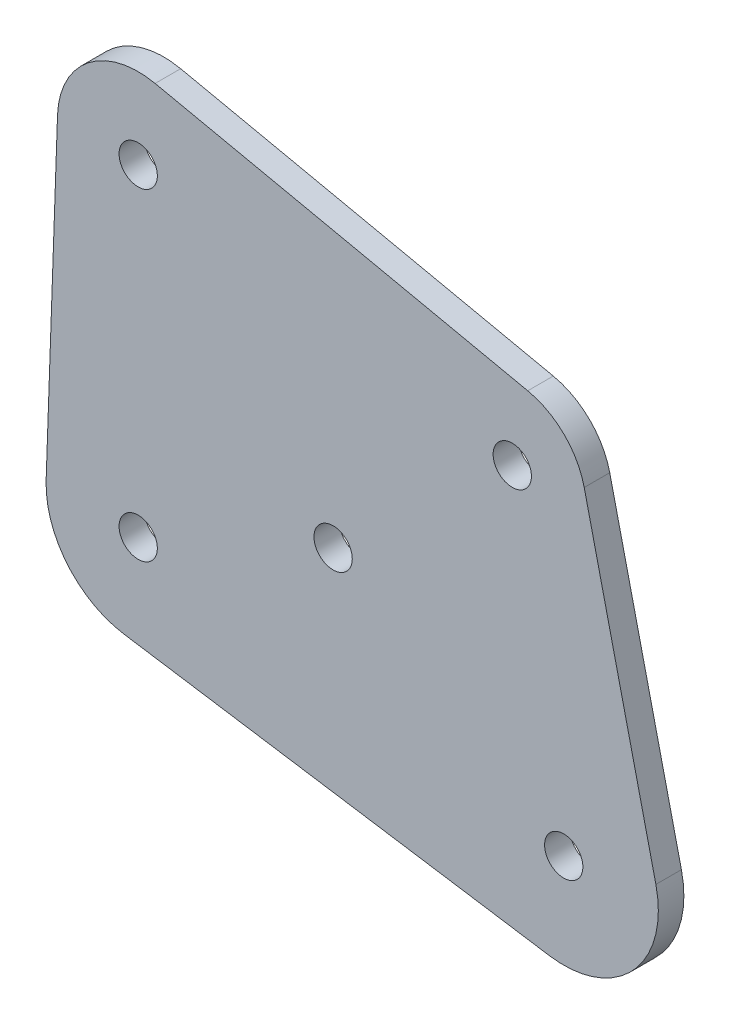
ISO-10303-21;
HEADER;
FILE_DESCRIPTION(('STEP AP214'),'2;1');
FILE_NAME('part.step','',(''),(''),'','','');
FILE_SCHEMA(('AUTOMOTIVE_DESIGN { 1 0 10303 214 1 1 1 1 }'));
ENDSEC;
DATA;
#1=APPLICATION_CONTEXT('core data for automotive mechanical design processes');
#2=APPLICATION_PROTOCOL_DEFINITION('international standard','automotive_design',2000,#1);
#3=PRODUCT_CONTEXT('',#1,'mechanical');
#4=PRODUCT('Part','Part','',(#3));
#5=PRODUCT_RELATED_PRODUCT_CATEGORY('part','',(#4));
#6=PRODUCT_DEFINITION_FORMATION('','',#4);
#7=PRODUCT_DEFINITION_CONTEXT('part definition',#1,'design');
#8=PRODUCT_DEFINITION('design','',#6,#7);
#9=PRODUCT_DEFINITION_SHAPE('','',#8);
#10=(LENGTH_UNIT() NAMED_UNIT(*) SI_UNIT(.MILLI.,.METRE.));
#11=(NAMED_UNIT(*) PLANE_ANGLE_UNIT() SI_UNIT($,.RADIAN.));
#12=(NAMED_UNIT(*) SI_UNIT($,.STERADIAN.) SOLID_ANGLE_UNIT());
#13=UNCERTAINTY_MEASURE_WITH_UNIT(LENGTH_MEASURE(1.E-05),#10,'distance_accuracy_value','');
#14=(GEOMETRIC_REPRESENTATION_CONTEXT(3) GLOBAL_UNCERTAINTY_ASSIGNED_CONTEXT((#13)) GLOBAL_UNIT_ASSIGNED_CONTEXT((#10,
#11,#12)) REPRESENTATION_CONTEXT('',''));
#15=CARTESIAN_POINT('',(0.,0.,0.));
#16=DIRECTION('',(0.,0.,1.));
#17=DIRECTION('',(1.,0.,0.));
#18=AXIS2_PLACEMENT_3D('',#15,#16,#17);
#19=CARTESIAN_POINT('',(1219.2,0.,25.4));
#20=DIRECTION('',(0.,0.,-1.));
#21=DIRECTION('',(-1.,0.,0.));
#22=AXIS2_PLACEMENT_3D('',#19,#20,#21);
#23=PLANE('',#22);
#24=CARTESIAN_POINT('',(325.83500035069,644.018315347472,25.4));
#25=DIRECTION('',(0.,0.,1.));
#26=DIRECTION('',(1.,0.,0.));
#27=AXIS2_PLACEMENT_3D('',#24,#25,#26);
#28=CIRCLE('',#27,19.05);
#29=CARTESIAN_POINT('',(344.88500035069,644.018315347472,25.4));
#30=VERTEX_POINT('',#29);
#31=EDGE_CURVE('E41',#30,#30,#28,.T.);
#32=ORIENTED_EDGE('',*,*,#31,.F.);
#33=EDGE_LOOP('',(#32));
#34=FACE_BOUND('',#33,.T.);
#35=CARTESIAN_POINT('',(697.941392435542,571.237089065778,25.4));
#36=DIRECTION('',(0.,0.,1.));
#37=DIRECTION('',(1.,0.,0.));
#38=AXIS2_PLACEMENT_3D('',#35,#36,#37);
#39=CIRCLE('',#38,19.05);
#40=CARTESIAN_POINT('',(716.991392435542,571.237089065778,25.4));
#41=VERTEX_POINT('',#40);
#42=EDGE_CURVE('E185',#41,#41,#39,.T.);
#43=ORIENTED_EDGE('',*,*,#42,.F.);
#44=EDGE_LOOP('',(#43));
#45=FACE_BOUND('',#44,.T.);
#46=CARTESIAN_POINT('',(519.736439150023,410.993406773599,25.4));
#47=DIRECTION('',(0.,0.,1.));
#48=DIRECTION('',(1.,0.,0.));
#49=AXIS2_PLACEMENT_3D('',#46,#47,#48);
#50=CIRCLE('',#49,19.05);
#51=CARTESIAN_POINT('',(538.786439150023,410.993406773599,25.4));
#52=VERTEX_POINT('',#51);
#53=EDGE_CURVE('E179',#52,#52,#50,.T.);
#54=ORIENTED_EDGE('',*,*,#53,.F.);
#55=EDGE_LOOP('',(#54));
#56=FACE_BOUND('',#55,.T.);
#57=CARTESIAN_POINT('',(749.130631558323,260.234388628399,25.4));
#58=DIRECTION('',(0.,0.,1.));
#59=DIRECTION('',(1.,0.,0.));
#60=AXIS2_PLACEMENT_3D('',#57,#58,#59);
#61=CIRCLE('',#60,19.05);
#62=CARTESIAN_POINT('',(768.180631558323,260.234388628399,25.4));
#63=VERTEX_POINT('',#62);
#64=EDGE_CURVE('E173',#63,#63,#61,.T.);
#65=ORIENTED_EDGE('',*,*,#64,.F.);
#66=EDGE_LOOP('',(#65));
#67=FACE_BOUND('',#66,.T.);
#68=CARTESIAN_POINT('',(325.83500035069,323.166907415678,25.4));
#69=DIRECTION('',(0.,0.,1.));
#70=DIRECTION('',(1.,0.,0.));
#71=AXIS2_PLACEMENT_3D('',#68,#69,#70);
#72=CIRCLE('',#71,19.05);
#73=CARTESIAN_POINT('',(344.88500035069,323.166907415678,25.4));
#74=VERTEX_POINT('',#73);
#75=EDGE_CURVE('E160',#74,#74,#72,.T.);
#76=ORIENTED_EDGE('',*,*,#75,.F.);
#77=EDGE_LOOP('',(#76));
#78=FACE_BOUND('',#77,.T.);
#79=CARTESIAN_POINT('',(325.83500035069,644.018315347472,25.4));
#80=DIRECTION('',(0.,0.,1.));
#81=DIRECTION('',(1.,0.,0.));
#82=AXIS2_PLACEMENT_3D('',#79,#80,#81);
#83=CIRCLE('',#82,80.2944043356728);
#84=CARTESIAN_POINT('',(342.660219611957,722.53011932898,25.4));
#85=VERTEX_POINT('',#84);
#86=CARTESIAN_POINT('',(245.590918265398,646.860613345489,25.4));
#87=VERTEX_POINT('',#86);
#88=EDGE_CURVE('E138',#85,#87,#83,.T.);
#89=ORIENTED_EDGE('',*,*,#88,.T.);
#90=DIRECTION('',(-0.0353984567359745,-0.999373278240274,0.));
#91=VECTOR('',#90,1.);
#92=CARTESIAN_POINT('',(245.590918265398,646.860613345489,25.4));
#93=LINE('',#92,#91);
#94=CARTESIAN_POINT('',(234.24039166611,326.411248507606,25.4));
#95=VERTEX_POINT('',#94);
#96=EDGE_CURVE('E141',#87,#95,#93,.T.);
#97=ORIENTED_EDGE('',*,*,#96,.T.);
#98=CARTESIAN_POINT('',(325.83500035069,323.166907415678,25.4));
#99=DIRECTION('',(0.,0.,1.));
#100=DIRECTION('',(1.,0.,0.));
#101=AXIS2_PLACEMENT_3D('',#98,#99,#100);
#102=CIRCLE('',#101,91.652049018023);
#103=CARTESIAN_POINT('',(311.834339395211,232.590533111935,25.4));
#104=VERTEX_POINT('',#103);
#105=EDGE_CURVE('E52',#95,#104,#102,.T.);
#106=ORIENTED_EDGE('',*,*,#105,.T.);
#107=DIRECTION('',(0.988263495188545,-0.152758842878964,0.));
#108=VECTOR('',#107,1.);
#109=CARTESIAN_POINT('',(311.834339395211,232.590533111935,25.4));
#110=LINE('',#109,#108);
#111=CARTESIAN_POINT('',(734.752925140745,167.218742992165,25.4));
#112=VERTEX_POINT('',#111);
#113=EDGE_CURVE('E109',#104,#112,#110,.T.);
#114=ORIENTED_EDGE('',*,*,#113,.T.);
#115=CARTESIAN_POINT('',(749.130631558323,260.234388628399,25.4));
#116=DIRECTION('',(0.,0.,1.));
#117=DIRECTION('',(1.,0.,0.));
#118=AXIS2_PLACEMENT_3D('',#115,#116,#117);
#119=CIRCLE('',#118,94.120288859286);
#120=CARTESIAN_POINT('',(840.801457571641,281.567190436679,25.4));
#121=VERTEX_POINT('',#120);
#122=EDGE_CURVE('E146',#112,#121,#119,.T.);
#123=ORIENTED_EDGE('',*,*,#122,.T.);
#124=DIRECTION('',(-0.226654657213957,0.973975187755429,0.));
#125=VECTOR('',#124,1.);
#126=CARTESIAN_POINT('',(840.801457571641,281.567190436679,25.4));
#127=LINE('',#126,#125);
#128=CARTESIAN_POINT('',(769.516030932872,587.893288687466,25.4));
#129=VERTEX_POINT('',#128);
#130=EDGE_CURVE('E149',#121,#129,#127,.T.);
#131=ORIENTED_EDGE('',*,*,#130,.T.);
#132=CARTESIAN_POINT('',(697.941392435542,571.237089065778,25.4));
#133=DIRECTION('',(0.,0.,1.));
#134=DIRECTION('',(1.,0.,0.));
#135=AXIS2_PLACEMENT_3D('',#132,#133,#134);
#136=CIRCLE('',#135,73.4871271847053);
#137=CARTESIAN_POINT('',(713.34018688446,643.09274292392,25.4));
#138=VERTEX_POINT('',#137);
#139=EDGE_CURVE('E152',#129,#138,#136,.T.);
#140=ORIENTED_EDGE('',*,*,#139,.T.);
#141=DIRECTION('',(-0.977799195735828,0.209544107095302,0.));
#142=VECTOR('',#141,1.);
#143=CARTESIAN_POINT('',(713.34018688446,643.09274292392,25.4));
#144=LINE('',#143,#142);
#145=EDGE_CURVE('E155',#138,#85,#144,.T.);
#146=ORIENTED_EDGE('',*,*,#145,.T.);
#147=EDGE_LOOP('',(#89,#97,#106,#114,#123,#131,#140,#146));
#148=FACE_BOUND('',#147,.T.);
#149=ADVANCED_FACE('F37',(#34,#45,#56,#67,#78,#148),#23,.F.);
#150=CARTESIAN_POINT('',(1219.2,0.,0.));
#151=DIRECTION('',(0.,0.,-1.));
#152=DIRECTION('',(-1.,0.,0.));
#153=AXIS2_PLACEMENT_3D('',#150,#151,#152);
#154=PLANE('',#153);
#155=CARTESIAN_POINT('',(325.83500035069,644.018315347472,0.));
#156=DIRECTION('',(0.,0.,1.));
#157=DIRECTION('',(1.,0.,0.));
#158=AXIS2_PLACEMENT_3D('',#155,#156,#157);
#159=CIRCLE('',#158,19.05);
#160=CARTESIAN_POINT('',(344.88500035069,644.018315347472,0.));
#161=VERTEX_POINT('',#160);
#162=EDGE_CURVE('E12',#161,#161,#159,.T.);
#163=ORIENTED_EDGE('',*,*,#162,.T.);
#164=EDGE_LOOP('',(#163));
#165=FACE_BOUND('',#164,.T.);
#166=CARTESIAN_POINT('',(697.941392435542,571.237089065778,0.));
#167=DIRECTION('',(0.,0.,1.));
#168=DIRECTION('',(1.,0.,0.));
#169=AXIS2_PLACEMENT_3D('',#166,#167,#168);
#170=CIRCLE('',#169,19.05);
#171=CARTESIAN_POINT('',(716.991392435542,571.237089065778,0.));
#172=VERTEX_POINT('',#171);
#173=EDGE_CURVE('E188',#172,#172,#170,.T.);
#174=ORIENTED_EDGE('',*,*,#173,.T.);
#175=EDGE_LOOP('',(#174));
#176=FACE_BOUND('',#175,.T.);
#177=CARTESIAN_POINT('',(519.736439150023,410.993406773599,0.));
#178=DIRECTION('',(0.,0.,1.));
#179=DIRECTION('',(1.,0.,0.));
#180=AXIS2_PLACEMENT_3D('',#177,#178,#179);
#181=CIRCLE('',#180,19.05);
#182=CARTESIAN_POINT('',(538.786439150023,410.993406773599,0.));
#183=VERTEX_POINT('',#182);
#184=EDGE_CURVE('E182',#183,#183,#181,.T.);
#185=ORIENTED_EDGE('',*,*,#184,.T.);
#186=EDGE_LOOP('',(#185));
#187=FACE_BOUND('',#186,.T.);
#188=CARTESIAN_POINT('',(749.130631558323,260.234388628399,0.));
#189=DIRECTION('',(0.,0.,1.));
#190=DIRECTION('',(1.,0.,0.));
#191=AXIS2_PLACEMENT_3D('',#188,#189,#190);
#192=CIRCLE('',#191,19.05);
#193=CARTESIAN_POINT('',(768.180631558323,260.234388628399,0.));
#194=VERTEX_POINT('',#193);
#195=EDGE_CURVE('E176',#194,#194,#192,.T.);
#196=ORIENTED_EDGE('',*,*,#195,.T.);
#197=EDGE_LOOP('',(#196));
#198=FACE_BOUND('',#197,.T.);
#199=CARTESIAN_POINT('',(325.83500035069,323.166907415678,0.));
#200=DIRECTION('',(0.,0.,1.));
#201=DIRECTION('',(1.,0.,0.));
#202=AXIS2_PLACEMENT_3D('',#199,#200,#201);
#203=CIRCLE('',#202,19.05);
#204=CARTESIAN_POINT('',(344.88500035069,323.166907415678,0.));
#205=VERTEX_POINT('',#204);
#206=EDGE_CURVE('E170',#205,#205,#203,.T.);
#207=ORIENTED_EDGE('',*,*,#206,.T.);
#208=EDGE_LOOP('',(#207));
#209=FACE_BOUND('',#208,.T.);
#210=DIRECTION('',(-0.0353984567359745,-0.999373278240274,0.));
#211=VECTOR('',#210,1.);
#212=CARTESIAN_POINT('',(245.590918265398,646.860613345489,0.));
#213=LINE('',#212,#211);
#214=CARTESIAN_POINT('',(245.590918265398,646.860613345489,0.));
#215=VERTEX_POINT('',#214);
#216=CARTESIAN_POINT('',(234.24039166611,326.411248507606,0.));
#217=VERTEX_POINT('',#216);
#218=EDGE_CURVE('E119',#215,#217,#213,.T.);
#219=ORIENTED_EDGE('',*,*,#218,.F.);
#220=CARTESIAN_POINT('',(325.83500035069,644.018315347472,0.));
#221=DIRECTION('',(0.,0.,1.));
#222=DIRECTION('',(1.,0.,0.));
#223=AXIS2_PLACEMENT_3D('',#220,#221,#222);
#224=CIRCLE('',#223,80.2944043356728);
#225=CARTESIAN_POINT('',(342.660219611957,722.53011932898,0.));
#226=VERTEX_POINT('',#225);
#227=EDGE_CURVE('E60',#226,#215,#224,.T.);
#228=ORIENTED_EDGE('',*,*,#227,.F.);
#229=DIRECTION('',(-0.977799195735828,0.209544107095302,0.));
#230=VECTOR('',#229,1.);
#231=CARTESIAN_POINT('',(713.34018688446,643.09274292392,0.));
#232=LINE('',#231,#230);
#233=CARTESIAN_POINT('',(713.34018688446,643.09274292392,0.));
#234=VERTEX_POINT('',#233);
#235=EDGE_CURVE('E134',#234,#226,#232,.T.);
#236=ORIENTED_EDGE('',*,*,#235,.F.);
#237=CARTESIAN_POINT('',(697.941392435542,571.237089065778,0.));
#238=DIRECTION('',(0.,0.,1.));
#239=DIRECTION('',(1.,0.,0.));
#240=AXIS2_PLACEMENT_3D('',#237,#238,#239);
#241=CIRCLE('',#240,73.4871271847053);
#242=CARTESIAN_POINT('',(769.516030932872,587.893288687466,0.));
#243=VERTEX_POINT('',#242);
#244=EDGE_CURVE('E131',#243,#234,#241,.T.);
#245=ORIENTED_EDGE('',*,*,#244,.F.);
#246=DIRECTION('',(-0.226654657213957,0.973975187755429,0.));
#247=VECTOR('',#246,1.);
#248=CARTESIAN_POINT('',(840.801457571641,281.567190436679,0.));
#249=LINE('',#248,#247);
#250=CARTESIAN_POINT('',(840.801457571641,281.567190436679,0.));
#251=VERTEX_POINT('',#250);
#252=EDGE_CURVE('E125',#251,#243,#249,.T.);
#253=ORIENTED_EDGE('',*,*,#252,.F.);
#254=CARTESIAN_POINT('',(749.130631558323,260.234388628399,0.));
#255=DIRECTION('',(0.,0.,1.));
#256=DIRECTION('',(1.,0.,0.));
#257=AXIS2_PLACEMENT_3D('',#254,#255,#256);
#258=CIRCLE('',#257,94.120288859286);
#259=CARTESIAN_POINT('',(734.752925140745,167.218742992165,0.));
#260=VERTEX_POINT('',#259);
#261=EDGE_CURVE('E123',#260,#251,#258,.T.);
#262=ORIENTED_EDGE('',*,*,#261,.F.);
#263=DIRECTION('',(0.988263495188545,-0.152758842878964,0.));
#264=VECTOR('',#263,1.);
#265=CARTESIAN_POINT('',(311.834339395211,232.590533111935,0.));
#266=LINE('',#265,#264);
#267=CARTESIAN_POINT('',(311.834339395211,232.590533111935,0.));
#268=VERTEX_POINT('',#267);
#269=EDGE_CURVE('E106',#268,#260,#266,.T.);
#270=ORIENTED_EDGE('',*,*,#269,.F.);
#271=CARTESIAN_POINT('',(325.83500035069,323.166907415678,0.));
#272=DIRECTION('',(0.,0.,1.));
#273=DIRECTION('',(1.,0.,0.));
#274=AXIS2_PLACEMENT_3D('',#271,#272,#273);
#275=CIRCLE('',#274,91.652049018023);
#276=EDGE_CURVE('E114',#217,#268,#275,.T.);
#277=ORIENTED_EDGE('',*,*,#276,.F.);
#278=EDGE_LOOP('',(#219,#228,#236,#245,#253,#262,#270,#277));
#279=FACE_BOUND('',#278,.T.);
#280=ADVANCED_FACE('F39',(#165,#176,#187,#198,#209,#279),#154,.T.);
#281=CARTESIAN_POINT('',(325.83500035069,644.018315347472,0.));
#282=DIRECTION('',(0.,0.,1.));
#283=DIRECTION('',(1.,0.,0.));
#284=AXIS2_PLACEMENT_3D('',#281,#282,#283);
#285=CYLINDRICAL_SURFACE('',#284,19.05);
#286=ORIENTED_EDGE('',*,*,#162,.F.);
#287=EDGE_LOOP('',(#286));
#288=FACE_BOUND('',#287,.T.);
#289=ORIENTED_EDGE('',*,*,#31,.T.);
#290=EDGE_LOOP('',(#289));
#291=FACE_BOUND('',#290,.T.);
#292=ADVANCED_FACE('F255',(#288,#291),#285,.F.);
#293=CARTESIAN_POINT('',(697.941392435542,571.237089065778,0.));
#294=DIRECTION('',(0.,0.,1.));
#295=DIRECTION('',(1.,0.,0.));
#296=AXIS2_PLACEMENT_3D('',#293,#294,#295);
#297=CYLINDRICAL_SURFACE('',#296,19.05);
#298=ORIENTED_EDGE('',*,*,#173,.F.);
#299=EDGE_LOOP('',(#298));
#300=FACE_BOUND('',#299,.T.);
#301=ORIENTED_EDGE('',*,*,#42,.T.);
#302=EDGE_LOOP('',(#301));
#303=FACE_BOUND('',#302,.T.);
#304=ADVANCED_FACE('F194',(#300,#303),#297,.F.);
#305=CARTESIAN_POINT('',(519.736439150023,410.993406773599,0.));
#306=DIRECTION('',(0.,0.,1.));
#307=DIRECTION('',(1.,0.,0.));
#308=AXIS2_PLACEMENT_3D('',#305,#306,#307);
#309=CYLINDRICAL_SURFACE('',#308,19.05);
#310=ORIENTED_EDGE('',*,*,#184,.F.);
#311=EDGE_LOOP('',(#310));
#312=FACE_BOUND('',#311,.T.);
#313=ORIENTED_EDGE('',*,*,#53,.T.);
#314=EDGE_LOOP('',(#313));
#315=FACE_BOUND('',#314,.T.);
#316=ADVANCED_FACE('F248',(#312,#315),#309,.F.);
#317=CARTESIAN_POINT('',(749.130631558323,260.234388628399,0.));
#318=DIRECTION('',(0.,0.,1.));
#319=DIRECTION('',(1.,0.,0.));
#320=AXIS2_PLACEMENT_3D('',#317,#318,#319);
#321=CYLINDRICAL_SURFACE('',#320,19.05);
#322=ORIENTED_EDGE('',*,*,#195,.F.);
#323=EDGE_LOOP('',(#322));
#324=FACE_BOUND('',#323,.T.);
#325=ORIENTED_EDGE('',*,*,#64,.T.);
#326=EDGE_LOOP('',(#325));
#327=FACE_BOUND('',#326,.T.);
#328=ADVANCED_FACE('F244',(#324,#327),#321,.F.);
#329=CARTESIAN_POINT('',(325.83500035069,323.166907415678,0.));
#330=DIRECTION('',(0.,0.,1.));
#331=DIRECTION('',(1.,0.,0.));
#332=AXIS2_PLACEMENT_3D('',#329,#330,#331);
#333=CYLINDRICAL_SURFACE('',#332,19.05);
#334=ORIENTED_EDGE('',*,*,#206,.F.);
#335=EDGE_LOOP('',(#334));
#336=FACE_BOUND('',#335,.T.);
#337=ORIENTED_EDGE('',*,*,#75,.T.);
#338=EDGE_LOOP('',(#337));
#339=FACE_BOUND('',#338,.T.);
#340=ADVANCED_FACE('F241',(#336,#339),#333,.F.);
#341=CARTESIAN_POINT('',(325.83500035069,644.018315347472,0.));
#342=DIRECTION('',(0.,0.,1.));
#343=DIRECTION('',(1.,0.,0.));
#344=AXIS2_PLACEMENT_3D('',#341,#342,#343);
#345=CYLINDRICAL_SURFACE('',#344,80.2944043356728);
#346=ORIENTED_EDGE('',*,*,#88,.F.);
#347=DIRECTION('',(0.,0.,1.));
#348=VECTOR('',#347,1.);
#349=CARTESIAN_POINT('',(342.660219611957,722.53011932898,0.));
#350=LINE('',#349,#348);
#351=EDGE_CURVE('E158',#226,#85,#350,.T.);
#352=ORIENTED_EDGE('',*,*,#351,.F.);
#353=ORIENTED_EDGE('',*,*,#227,.T.);
#354=DIRECTION('',(0.,0.,1.));
#355=VECTOR('',#354,1.);
#356=CARTESIAN_POINT('',(245.590918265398,646.860613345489,0.));
#357=LINE('',#356,#355);
#358=EDGE_CURVE('E137',#215,#87,#357,.T.);
#359=ORIENTED_EDGE('',*,*,#358,.T.);
#360=EDGE_LOOP('',(#346,#352,#353,#359));
#361=FACE_BOUND('',#360,.T.);
#362=ADVANCED_FACE('F208',(#361),#345,.T.);
#363=CARTESIAN_POINT('',(713.34018688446,643.09274292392,0.));
#364=DIRECTION('',(0.209544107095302,0.977799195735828,0.));
#365=DIRECTION('',(-0.977799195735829,0.209544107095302,0.));
#366=AXIS2_PLACEMENT_3D('',#363,#364,#365);
#367=PLANE('',#366);
#368=ORIENTED_EDGE('',*,*,#145,.F.);
#369=DIRECTION('',(0.,0.,1.));
#370=VECTOR('',#369,1.);
#371=CARTESIAN_POINT('',(713.34018688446,643.09274292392,0.));
#372=LINE('',#371,#370);
#373=EDGE_CURVE('E161',#234,#138,#372,.T.);
#374=ORIENTED_EDGE('',*,*,#373,.F.);
#375=ORIENTED_EDGE('',*,*,#235,.T.);
#376=ORIENTED_EDGE('',*,*,#351,.T.);
#377=EDGE_LOOP('',(#368,#374,#375,#376));
#378=FACE_BOUND('',#377,.T.);
#379=ADVANCED_FACE('F215',(#378),#367,.T.);
#380=CARTESIAN_POINT('',(697.941392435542,571.237089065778,0.));
#381=DIRECTION('',(0.,0.,1.));
#382=DIRECTION('',(1.,0.,0.));
#383=AXIS2_PLACEMENT_3D('',#380,#381,#382);
#384=CYLINDRICAL_SURFACE('',#383,73.4871271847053);
#385=ORIENTED_EDGE('',*,*,#139,.F.);
#386=DIRECTION('',(0.,0.,1.));
#387=VECTOR('',#386,1.);
#388=CARTESIAN_POINT('',(769.516030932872,587.893288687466,0.));
#389=LINE('',#388,#387);
#390=EDGE_CURVE('E163',#243,#129,#389,.T.);
#391=ORIENTED_EDGE('',*,*,#390,.F.);
#392=ORIENTED_EDGE('',*,*,#244,.T.);
#393=ORIENTED_EDGE('',*,*,#373,.T.);
#394=EDGE_LOOP('',(#385,#391,#392,#393));
#395=FACE_BOUND('',#394,.T.);
#396=ADVANCED_FACE('F218',(#395),#384,.T.);
#397=CARTESIAN_POINT('',(840.801457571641,281.567190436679,0.));
#398=DIRECTION('',(0.973975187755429,0.226654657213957,0.));
#399=DIRECTION('',(-0.226654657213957,0.973975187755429,0.));
#400=AXIS2_PLACEMENT_3D('',#397,#398,#399);
#401=PLANE('',#400);
#402=ORIENTED_EDGE('',*,*,#130,.F.);
#403=DIRECTION('',(0.,0.,1.));
#404=VECTOR('',#403,1.);
#405=CARTESIAN_POINT('',(840.801457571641,281.567190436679,0.));
#406=LINE('',#405,#404);
#407=EDGE_CURVE('E165',#251,#121,#406,.T.);
#408=ORIENTED_EDGE('',*,*,#407,.F.);
#409=ORIENTED_EDGE('',*,*,#252,.T.);
#410=ORIENTED_EDGE('',*,*,#390,.T.);
#411=EDGE_LOOP('',(#402,#408,#409,#410));
#412=FACE_BOUND('',#411,.T.);
#413=ADVANCED_FACE('F221',(#412),#401,.T.);
#414=CARTESIAN_POINT('',(749.130631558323,260.234388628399,0.));
#415=DIRECTION('',(0.,0.,1.));
#416=DIRECTION('',(1.,0.,0.));
#417=AXIS2_PLACEMENT_3D('',#414,#415,#416);
#418=CYLINDRICAL_SURFACE('',#417,94.120288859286);
#419=ORIENTED_EDGE('',*,*,#122,.F.);
#420=DIRECTION('',(0.,0.,1.));
#421=VECTOR('',#420,1.);
#422=CARTESIAN_POINT('',(734.752925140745,167.218742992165,0.));
#423=LINE('',#422,#421);
#424=EDGE_CURVE('E110',#260,#112,#423,.T.);
#425=ORIENTED_EDGE('',*,*,#424,.F.);
#426=ORIENTED_EDGE('',*,*,#261,.T.);
#427=ORIENTED_EDGE('',*,*,#407,.T.);
#428=EDGE_LOOP('',(#419,#425,#426,#427));
#429=FACE_BOUND('',#428,.T.);
#430=ADVANCED_FACE('F224',(#429),#418,.T.);
#431=CARTESIAN_POINT('',(311.834339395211,232.590533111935,0.));
#432=DIRECTION('',(-0.152758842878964,-0.988263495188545,0.));
#433=DIRECTION('',(0.988263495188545,-0.152758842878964,0.));
#434=AXIS2_PLACEMENT_3D('',#431,#432,#433);
#435=PLANE('',#434);
#436=ORIENTED_EDGE('',*,*,#113,.F.);
#437=DIRECTION('',(0.,0.,1.));
#438=VECTOR('',#437,1.);
#439=CARTESIAN_POINT('',(311.834339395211,232.590533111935,0.));
#440=LINE('',#439,#438);
#441=EDGE_CURVE('E102',#268,#104,#440,.T.);
#442=ORIENTED_EDGE('',*,*,#441,.F.);
#443=ORIENTED_EDGE('',*,*,#269,.T.);
#444=ORIENTED_EDGE('',*,*,#424,.T.);
#445=EDGE_LOOP('',(#436,#442,#443,#444));
#446=FACE_BOUND('',#445,.T.);
#447=ADVANCED_FACE('F104',(#446),#435,.T.);
#448=CARTESIAN_POINT('',(325.83500035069,323.166907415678,0.));
#449=DIRECTION('',(0.,0.,1.));
#450=DIRECTION('',(1.,0.,0.));
#451=AXIS2_PLACEMENT_3D('',#448,#449,#450);
#452=CYLINDRICAL_SURFACE('',#451,91.652049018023);
#453=ORIENTED_EDGE('',*,*,#105,.F.);
#454=DIRECTION('',(0.,0.,1.));
#455=VECTOR('',#454,1.);
#456=CARTESIAN_POINT('',(234.24039166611,326.411248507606,0.));
#457=LINE('',#456,#455);
#458=EDGE_CURVE('E111',#217,#95,#457,.T.);
#459=ORIENTED_EDGE('',*,*,#458,.F.);
#460=ORIENTED_EDGE('',*,*,#276,.T.);
#461=ORIENTED_EDGE('',*,*,#441,.T.);
#462=EDGE_LOOP('',(#453,#459,#460,#461));
#463=FACE_BOUND('',#462,.T.);
#464=ADVANCED_FACE('F115',(#463),#452,.T.);
#465=CARTESIAN_POINT('',(245.590918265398,646.860613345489,0.));
#466=DIRECTION('',(-0.999373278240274,0.0353984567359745,0.));
#467=DIRECTION('',(-0.0353984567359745,-0.999373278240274,0.));
#468=AXIS2_PLACEMENT_3D('',#465,#466,#467);
#469=PLANE('',#468);
#470=ORIENTED_EDGE('',*,*,#96,.F.);
#471=ORIENTED_EDGE('',*,*,#358,.F.);
#472=ORIENTED_EDGE('',*,*,#218,.T.);
#473=ORIENTED_EDGE('',*,*,#458,.T.);
#474=EDGE_LOOP('',(#470,#471,#472,#473));
#475=FACE_BOUND('',#474,.T.);
#476=ADVANCED_FACE('F210',(#475),#469,.T.);
#477=CLOSED_SHELL('',(#149,#280,#292,#304,#316,#328,#340,#362,#379,#396,#413,#430,#447,#464,#476));
#478=MANIFOLD_SOLID_BREP('B2',#477);
#479=ADVANCED_BREP_SHAPE_REPRESENTATION('',(#18,#478),#14);
#480=SHAPE_DEFINITION_REPRESENTATION(#9,#479);
ENDSEC;
END-ISO-10303-21;
